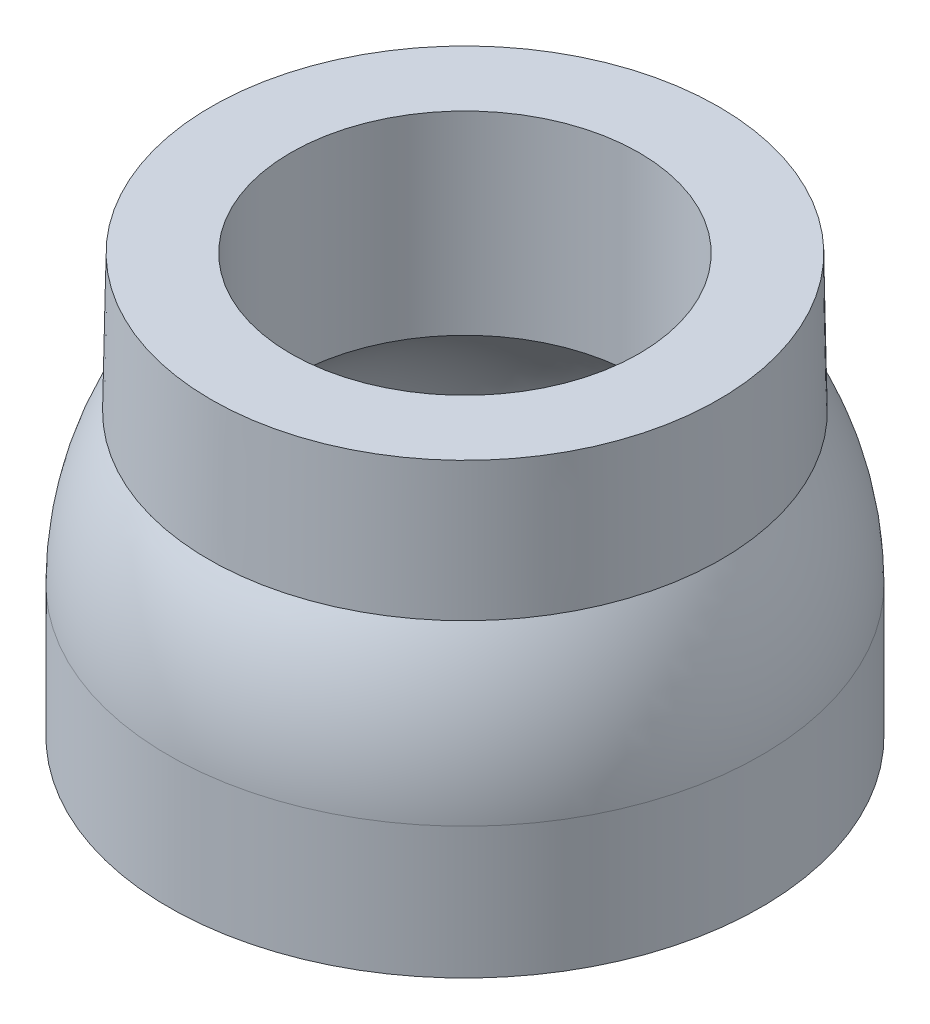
ISO-10303-21;
HEADER;
FILE_DESCRIPTION(('STEP AP214'),'2;1');
FILE_NAME('part.step','',(''),(''),'','','');
FILE_SCHEMA(('AUTOMOTIVE_DESIGN { 1 0 10303 214 1 1 1 1 }'));
ENDSEC;
DATA;
#1=APPLICATION_CONTEXT('core data for automotive mechanical design processes');
#2=APPLICATION_PROTOCOL_DEFINITION('international standard','automotive_design',2000,#1);
#3=PRODUCT_CONTEXT('',#1,'mechanical');
#4=PRODUCT('Part','Part','',(#3));
#5=PRODUCT_RELATED_PRODUCT_CATEGORY('part','',(#4));
#6=PRODUCT_DEFINITION_FORMATION('','',#4);
#7=PRODUCT_DEFINITION_CONTEXT('part definition',#1,'design');
#8=PRODUCT_DEFINITION('design','',#6,#7);
#9=PRODUCT_DEFINITION_SHAPE('','',#8);
#10=(LENGTH_UNIT() NAMED_UNIT(*) SI_UNIT(.MILLI.,.METRE.));
#11=(NAMED_UNIT(*) PLANE_ANGLE_UNIT() SI_UNIT($,.RADIAN.));
#12=(NAMED_UNIT(*) SI_UNIT($,.STERADIAN.) SOLID_ANGLE_UNIT());
#13=UNCERTAINTY_MEASURE_WITH_UNIT(LENGTH_MEASURE(1.E-05),#10,'distance_accuracy_value','');
#14=(GEOMETRIC_REPRESENTATION_CONTEXT(3) GLOBAL_UNCERTAINTY_ASSIGNED_CONTEXT((#13)) GLOBAL_UNIT_ASSIGNED_CONTEXT((#10,
#11,#12)) REPRESENTATION_CONTEXT('',''));
#15=CARTESIAN_POINT('',(0.,0.,0.));
#16=DIRECTION('',(0.,0.,1.));
#17=DIRECTION('',(1.,0.,0.));
#18=AXIS2_PLACEMENT_3D('',#15,#16,#17);
#19=CARTESIAN_POINT('',(-0.0550952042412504,0.242556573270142,0.));
#20=DIRECTION('',(0.,-1.,0.));
#21=DIRECTION('',(0.,0.,-1.));
#22=AXIS2_PLACEMENT_3D('',#19,#20,#21);
#23=CYLINDRICAL_SURFACE('',#22,5.81860550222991);
#24=CARTESIAN_POINT('',(-0.0550952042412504,5.73289627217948,0.));
#25=DIRECTION('',(0.,-1.,0.));
#26=DIRECTION('',(0.,0.,-1.));
#27=AXIS2_PLACEMENT_3D('',#24,#25,#26);
#28=CIRCLE('',#27,5.81860550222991);
#29=CARTESIAN_POINT('',(-0.0550952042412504,5.73289627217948,-5.81860550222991));
#30=VERTEX_POINT('',#29);
#31=EDGE_CURVE('E59',#30,#30,#28,.T.);
#32=ORIENTED_EDGE('',*,*,#31,.T.);
#33=EDGE_LOOP('',(#32));
#34=FACE_BOUND('',#33,.T.);
#35=CARTESIAN_POINT('',(-0.0550952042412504,12.2219626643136,0.));
#36=DIRECTION('',(0.,-1.,0.));
#37=DIRECTION('',(0.,0.,-1.));
#38=AXIS2_PLACEMENT_3D('',#35,#36,#37);
#39=CIRCLE('',#38,5.81860550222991);
#40=CARTESIAN_POINT('',(-0.0550952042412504,12.2219626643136,-5.81860550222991));
#41=VERTEX_POINT('',#40);
#42=EDGE_CURVE('E10',#41,#41,#39,.T.);
#43=ORIENTED_EDGE('',*,*,#42,.F.);
#44=EDGE_LOOP('',(#43));
#45=FACE_BOUND('',#44,.T.);
#46=ADVANCED_FACE('F31',(#34,#45),#23,.F.);
#47=CARTESIAN_POINT('',(5.76351029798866,12.2219626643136,0.));
#48=DIRECTION('',(0.,1.,0.));
#49=DIRECTION('',(0.,0.,1.));
#50=AXIS2_PLACEMENT_3D('',#47,#48,#49);
#51=PLANE('',#50);
#52=ORIENTED_EDGE('',*,*,#42,.T.);
#53=EDGE_LOOP('',(#52));
#54=FACE_BOUND('',#53,.T.);
#55=CARTESIAN_POINT('',(-0.0550952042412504,12.2219626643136,0.));
#56=DIRECTION('',(0.,-1.,0.));
#57=DIRECTION('',(0.,0.,-1.));
#58=AXIS2_PLACEMENT_3D('',#55,#56,#57);
#59=CIRCLE('',#58,8.47824297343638);
#60=CARTESIAN_POINT('',(-0.0550952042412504,12.2219626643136,-8.47824297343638));
#61=VERTEX_POINT('',#60);
#62=EDGE_CURVE('E37',#61,#61,#59,.T.);
#63=ORIENTED_EDGE('',*,*,#62,.F.);
#64=EDGE_LOOP('',(#63));
#65=FACE_BOUND('',#64,.T.);
#66=ADVANCED_FACE('F77',(#54,#65),#51,.T.);
#67=CARTESIAN_POINT('',(-0.0550952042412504,7.63971567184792,0.));
#68=DIRECTION('',(0.,-1.,0.));
#69=DIRECTION('',(0.,0.,-1.));
#70=AXIS2_PLACEMENT_3D('',#67,#68,#69);
#71=CONICAL_SURFACE('',#70,8.56083262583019,0.0180218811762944);
#72=ORIENTED_EDGE('',*,*,#62,.T.);
#73=EDGE_LOOP('',(#72));
#74=FACE_BOUND('',#73,.T.);
#75=CARTESIAN_POINT('',(-0.0550952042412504,7.63971567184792,0.));
#76=DIRECTION('',(0.,-1.,0.));
#77=DIRECTION('',(0.,0.,-1.));
#78=AXIS2_PLACEMENT_3D('',#75,#76,#77);
#79=CIRCLE('',#78,8.56083262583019);
#80=CARTESIAN_POINT('',(-0.0550952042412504,7.63971567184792,-8.56083262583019));
#81=VERTEX_POINT('',#80);
#82=EDGE_CURVE('E41',#81,#81,#79,.T.);
#83=ORIENTED_EDGE('',*,*,#82,.F.);
#84=EDGE_LOOP('',(#83));
#85=FACE_BOUND('',#84,.T.);
#86=ADVANCED_FACE('F81',(#74,#85),#71,.T.);
#87=CARTESIAN_POINT('',(-0.0550952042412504,2.64071794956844,0.));
#88=DIRECTION('',(0.,-1.,0.));
#89=DIRECTION('',(0.,0.,-1.));
#90=AXIS2_PLACEMENT_3D('',#87,#88,#89);
#91=DEGENERATE_TOROIDAL_SURFACE('',#90,0.100000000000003,10.,.F.);
#92=ORIENTED_EDGE('',*,*,#82,.T.);
#93=EDGE_LOOP('',(#92));
#94=FACE_BOUND('',#93,.T.);
#95=CARTESIAN_POINT('',(-0.0550952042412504,2.64071794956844,0.));
#96=DIRECTION('',(0.,-1.,0.));
#97=DIRECTION('',(0.,0.,-1.));
#98=AXIS2_PLACEMENT_3D('',#95,#96,#97);
#99=CIRCLE('',#98,9.9);
#100=CARTESIAN_POINT('',(-0.0550952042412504,2.64071794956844,-9.9));
#101=VERTEX_POINT('',#100);
#102=EDGE_CURVE('E45',#101,#101,#99,.T.);
#103=ORIENTED_EDGE('',*,*,#102,.F.);
#104=EDGE_LOOP('',(#103));
#105=FACE_BOUND('',#104,.T.);
#106=ADVANCED_FACE('F85',(#94,#105),#91,.F.);
#107=CARTESIAN_POINT('',(-0.0550952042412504,0.242556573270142,0.));
#108=DIRECTION('',(0.,-1.,0.));
#109=DIRECTION('',(0.,0.,-1.));
#110=AXIS2_PLACEMENT_3D('',#107,#108,#109);
#111=CYLINDRICAL_SURFACE('',#110,9.9);
#112=ORIENTED_EDGE('',*,*,#102,.T.);
#113=EDGE_LOOP('',(#112));
#114=FACE_BOUND('',#113,.T.);
#115=CARTESIAN_POINT('',(-0.0550952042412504,-1.75272759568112,0.));
#116=DIRECTION('',(0.,-1.,0.));
#117=DIRECTION('',(0.,0.,-1.));
#118=AXIS2_PLACEMENT_3D('',#115,#116,#117);
#119=CIRCLE('',#118,9.9);
#120=CARTESIAN_POINT('',(-0.0550952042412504,-1.75272759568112,-9.9));
#121=VERTEX_POINT('',#120);
#122=EDGE_CURVE('E50',#121,#121,#119,.T.);
#123=ORIENTED_EDGE('',*,*,#122,.F.);
#124=EDGE_LOOP('',(#123));
#125=FACE_BOUND('',#124,.T.);
#126=ADVANCED_FACE('F91',(#114,#125),#111,.T.);
#127=CARTESIAN_POINT('',(7.94490479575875,-1.75272759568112,0.));
#128=DIRECTION('',(0.,-1.,0.));
#129=DIRECTION('',(0.,0.,-1.));
#130=AXIS2_PLACEMENT_3D('',#127,#128,#129);
#131=PLANE('',#130);
#132=ORIENTED_EDGE('',*,*,#122,.T.);
#133=EDGE_LOOP('',(#132));
#134=FACE_BOUND('',#133,.T.);
#135=CARTESIAN_POINT('',(-0.0550952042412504,-1.75272759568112,0.));
#136=DIRECTION('',(0.,-1.,0.));
#137=DIRECTION('',(0.,0.,-1.));
#138=AXIS2_PLACEMENT_3D('',#135,#136,#137);
#139=CIRCLE('',#138,8.);
#140=CARTESIAN_POINT('',(-0.0550952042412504,-1.75272759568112,-8.));
#141=VERTEX_POINT('',#140);
#142=EDGE_CURVE('E53',#141,#141,#139,.T.);
#143=ORIENTED_EDGE('',*,*,#142,.F.);
#144=EDGE_LOOP('',(#143));
#145=FACE_BOUND('',#144,.T.);
#146=ADVANCED_FACE('F73',(#134,#145),#131,.T.);
#147=CARTESIAN_POINT('',(-0.0550952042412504,0.242556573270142,0.));
#148=DIRECTION('',(0.,-1.,0.));
#149=DIRECTION('',(0.,0.,-1.));
#150=AXIS2_PLACEMENT_3D('',#147,#148,#149);
#151=CYLINDRICAL_SURFACE('',#150,8.);
#152=ORIENTED_EDGE('',*,*,#142,.T.);
#153=EDGE_LOOP('',(#152));
#154=FACE_BOUND('',#153,.T.);
#155=CARTESIAN_POINT('',(-0.0550952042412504,0.242556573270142,0.));
#156=DIRECTION('',(0.,-1.,0.));
#157=DIRECTION('',(0.,0.,-1.));
#158=AXIS2_PLACEMENT_3D('',#155,#156,#157);
#159=CIRCLE('',#158,8.);
#160=CARTESIAN_POINT('',(-0.0550952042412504,0.242556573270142,-8.));
#161=VERTEX_POINT('',#160);
#162=EDGE_CURVE('E56',#161,#161,#159,.T.);
#163=ORIENTED_EDGE('',*,*,#162,.F.);
#164=EDGE_LOOP('',(#163));
#165=FACE_BOUND('',#164,.T.);
#166=ADVANCED_FACE('F67',(#154,#165),#151,.F.);
#167=CARTESIAN_POINT('',(-0.0550952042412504,0.242556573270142,0.));
#168=DIRECTION('',(0.,-1.,0.));
#169=DIRECTION('',(1.,0.,0.));
#170=AXIS2_PLACEMENT_3D('',#167,#168,#169);
#171=SPHERICAL_SURFACE('',#170,8.);
#172=ORIENTED_EDGE('',*,*,#162,.T.);
#173=EDGE_LOOP('',(#172));
#174=FACE_BOUND('',#173,.T.);
#175=ORIENTED_EDGE('',*,*,#31,.F.);
#176=EDGE_LOOP('',(#175));
#177=FACE_BOUND('',#176,.T.);
#178=ADVANCED_FACE('F65',(#174,#177),#171,.F.);
#179=CLOSED_SHELL('',(#46,#66,#86,#106,#126,#146,#166,#178));
#180=MANIFOLD_SOLID_BREP('B2',#179);
#181=ADVANCED_BREP_SHAPE_REPRESENTATION('',(#18,#180),#14);
#182=SHAPE_DEFINITION_REPRESENTATION(#9,#181);
ENDSEC;
END-ISO-10303-21;
